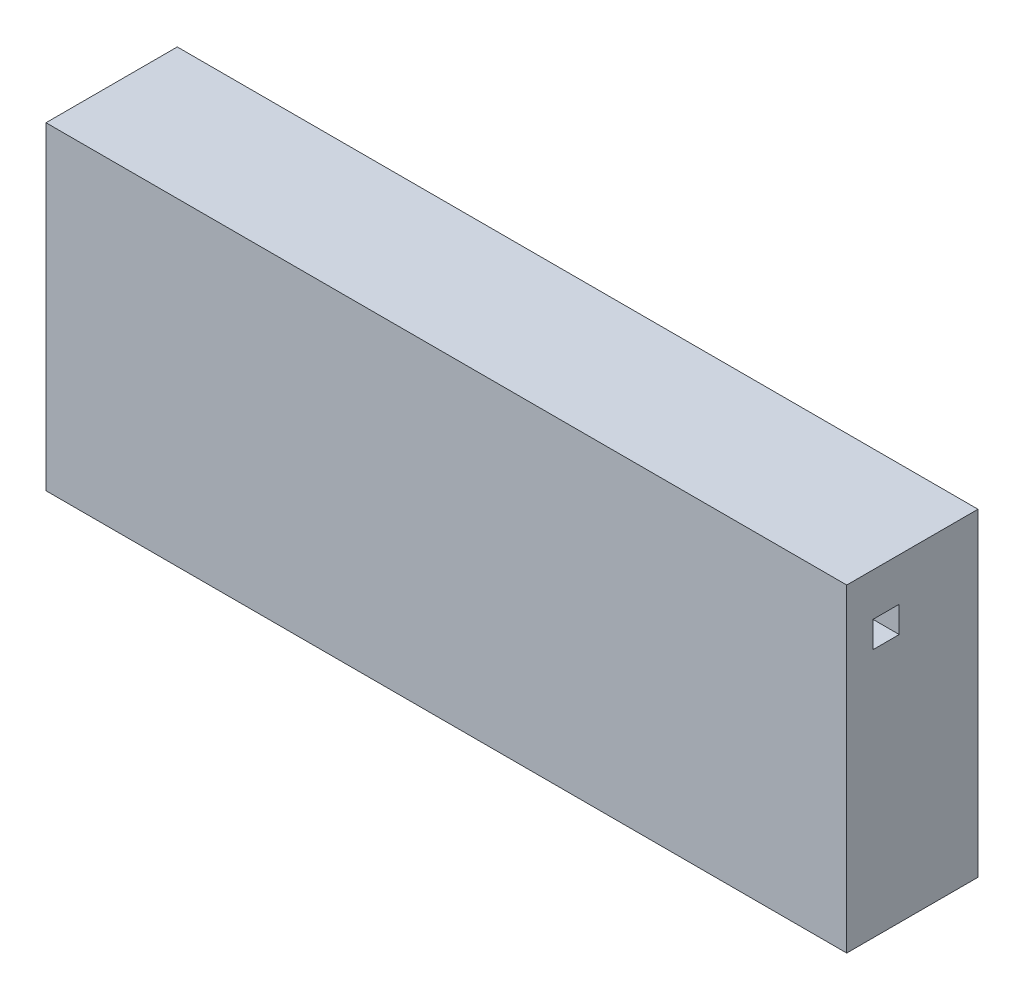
from build123d import *

# Parameters (mm, degrees)
SKIZZE1_W                         = 15.25
SKIZZE1_H                         = 10.05
BASIS_DEPTH                       = 2
KAN_LE_UNTEN_DEPTH                = 0.5
SKIZZE3_W                         = 15.25
SKIZZE3_H                         = 10.05
MITTE_DEPTH                       = 1
SKIZZE6_R                         = 0.25
SKIZZE6_R_2                       = 0.3125
S_ULEN_DEPTH                      = 1.5
SKIZZE4_W                         = 1
SKIZZE4_H                         = 0.499999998
KAN_LE_OBEN_DEPTH                 = 0.5
SKIZZE5_W                         = 15.25
SKIZZE5_H                         = 10.05
DECKEL_DEPTH                      = 1
SKIZZE12_W                        = 15.25
SKIZZE12_H                        = 3.9794873
CHEAT_MACH_ICH_NOCH_SCH_NER_DEPTH = 19.696657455
SCHNITT_LINEAR_START              = -0.5
SKIZZE13_W                        = 15.25
SKIZZE13_H                        = 6.0705127
SCHNITT_LINEAR_AUSTRAGEN1_DEPTH   = 18.934071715
SCHNITT_LINEAR_START_2            = 2
SKIZZE13_2_W                      = 15.25
SKIZZE13_2_H                      = 6.0705127
SCHNITT_LINEAR_AUSTRAGEN2_DEPTH   = 17.434071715


with BuildPart() as part:
    # Skizze1 → Basis (new body)
    with BuildSketch(Plane.XY):
        with Locations((7.625, 5.025)):
            Rectangle(SKIZZE1_W, SKIZZE1_H)
    extrude(amount=BASIS_DEPTH)

    # Skizze2 → Kan_le_unten (cut)
    with BuildSketch(Plane.XY.offset(2)):
        Polygon((0.5, 9.55), (0.75, 9.55), (0.75, 9.23349365), (2.4375, 9.23349365), (2.4375, 8.73349365), (0.75, 8.73349365), (0.75, 8.4169873), (0.5, 8.4169873), align=None)
        Polygon((1.87099365, 6.73349365), (2.1875, 6.73349365), (2.1875, 5.04599365), (2.6875, 5.04599365), (2.6875, 6.73349365), (3.00400635, 6.73349365), (3.00400635, 6.98349365), (1.87099365, 6.98349365), align=None)
        Polygon((6.375, 4.79599365), (4.6875, 4.79599365), (4.6875, 4.4794873), (4.4375, 4.4794873), (4.4375, 5.6125), (4.6875, 5.6125), (4.6875, 5.29599365), (6.375, 5.29599365), align=None)
        Polygon((6.625, 8.98349365), (6.625, 7.29599365), (6.94150635, 7.29599365), (6.94150635, 7.04599365), (5.80849365, 7.04599365), (5.80849365, 7.29599365), (6.125, 7.29599365), (6.125, 8.98349365), align=None)
        Polygon((10.3125, 9.23349365), (8.625, 9.23349365), (8.625, 9.55), (8.375, 9.55), (8.375, 8.4169873), (8.625, 8.4169873), (8.625, 8.73349365), (10.3125, 8.73349365), align=None)
        Polygon((10.0625, 5.04599365), (10.0625, 6.73349365), (9.74599365, 6.73349365), (9.74599365, 6.98349365), (10.87900635, 6.98349365), (10.87900635, 6.73349365), (10.5625, 6.73349365), (10.5625, 5.04599365), align=None)
        Polygon((14.25, 4.79599365), (12.5625, 4.79599365), (12.5625, 4.4794873), (12.3125, 4.4794873), (12.3125, 5.6125), (12.5625, 5.6125), (12.5625, 5.29599365), (14.25, 5.29599365), align=None)
        Polygon((14, 8.98349365), (14, 7.29599365), (13.68349365, 7.29599365), (13.68349365, 7.04599365), (14.81650635, 7.04599365), (14.81650635, 7.29599365), (14.5, 7.29599365), (14.5, 8.98349365), align=None)
    extrude(amount=-KAN_LE_UNTEN_DEPTH, mode=Mode.SUBTRACT)

    # Skizze3 → Mitte (add)
    with BuildSketch(Plane.XY.offset(2)):
        with Locations((7.625, 5.025)):
            Rectangle(SKIZZE3_W, SKIZZE3_H)
    extrude(amount=MITTE_DEPTH)

    # Skizze6 → S_ulen (cut)
    with BuildSketch(Plane.XY.offset(3)):
        with Locations((0.625, 8.4169873)):
            Circle(SKIZZE6_R)
        with Locations((0.625, 9.55)):
            Circle(SKIZZE6_R)
        with Locations((2.4375, 8.98349365)):
            Circle(SKIZZE6_R_2)
        with Locations((2.4375, 5.04599365)):
            Circle(SKIZZE6_R_2)
        with Locations((6.375, 5.04599365)):
            Circle(SKIZZE6_R_2)
        with Locations((6.375, 8.98349365)):
            Circle(SKIZZE6_R_2)
        with Locations((10.3125, 8.98349365)):
            Circle(SKIZZE6_R_2)
        with Locations((10.3125, 5.04599365)):
            Circle(SKIZZE6_R_2)
        with Locations((14.25, 5.04599365)):
            Circle(SKIZZE6_R_2)
        with Locations((14.25, 8.98349365)):
            Circle(SKIZZE6_R_2)
        with Locations((1.87099365, 6.85849365)):
            Circle(SKIZZE6_R)
        with Locations((3.00400635, 6.85849365)):
            Circle(SKIZZE6_R)
        with Locations((4.5625, 5.6125)):
            Circle(SKIZZE6_R)
        with Locations((4.5625, 4.4794873)):
            Circle(SKIZZE6_R)
        with Locations((6.94150635, 7.17099365)):
            Circle(SKIZZE6_R)
        with Locations((5.80849365, 7.17099365)):
            Circle(SKIZZE6_R)
        with Locations((8.5, 8.4169873)):
            Circle(SKIZZE6_R)
        with Locations((8.5, 9.55)):
            Circle(SKIZZE6_R)
        with Locations((9.74599365, 6.85849365)):
            Circle(SKIZZE6_R)
        with Locations((10.87900635, 6.85849365)):
            Circle(SKIZZE6_R)
        with Locations((12.4375, 5.6125)):
            Circle(SKIZZE6_R)
        with Locations((12.4375, 4.4794873)):
            Circle(SKIZZE6_R)
        with Locations((13.68349365, 7.17099365)):
            Circle(SKIZZE6_R)
        with Locations((14.81650635, 7.17099365)):
            Circle(SKIZZE6_R)
    extrude(amount=-S_ULEN_DEPTH, mode=Mode.SUBTRACT)

    # Skizze4 → Kan_le oben (cut)
    with BuildSketch(Plane.XY.offset(3)):
        with BuildLine():
            Line((1.8125, 8.983493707), (2.1875, 6.983493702))
            Line((2.1875, 6.983493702), (1.87099365, 6.983493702))
            Line((1.87099365, 6.983493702), (1.87099365, 6.733493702))
            Line((1.87099365, 6.733493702), (3.00400635, 6.733493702))
            Line((3.00400635, 6.733493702), (3.00400635, 6.983493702))
            Line((3.00400635, 6.983493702), (2.6875, 6.983493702))
            Line((2.6875, 6.983493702), (3.0625, 8.983493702))
            ThreePointArc((3.0625, 8.983493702), (2.437500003, 9.60849365), (1.8125, 8.983493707))
        make_face()
        Polygon((0, 9.233493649), (0, 8.733493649), (0.5, 8.733493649), (0.5, 8.416987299), (0.75, 8.416987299), (0.75, 9.549999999), (0.5, 9.549999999), (0.5, 9.233493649), align=None)
        with BuildLine():
            Line((4.6875, 4.4794873), (4.4375, 4.4794873))
            Line((4.4375, 4.4794873), (4.4375, 4.79599365))
            Line((4.4375, 4.79599365), (2.4375, 4.42099365))
            ThreePointArc((2.4375, 4.42099365), (1.8125, 5.04599365), (2.4375, 5.67099365))
            Line((2.4375, 5.67099365), (4.4375, 5.295993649))
            Line((4.4375, 5.295993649), (4.4375, 5.612499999))
            Line((4.4375, 5.612499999), (4.6875, 5.612499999))
            Line((4.6875, 5.612499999), (4.6875, 4.4794873))
        make_face()
        with BuildLine():
            Line((6.94150635, 7.29599365), (5.808493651, 7.29599365))
            Line((5.808493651, 7.29599365), (5.808493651, 7.04599365))
            Line((5.808493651, 7.04599365), (6.125000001, 7.04599365))
            Line((6.125000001, 7.04599365), (5.75, 5.04599365))
            ThreePointArc((5.75, 5.04599365), (6.375, 4.42099365), (7, 5.04599365))
            Line((7, 5.04599365), (6.6259058, 7.04599365))
            Line((6.6259058, 7.04599365), (6.94150635, 7.04599365))
            Line((6.94150635, 7.04599365), (6.94150635, 7.29599365))
        make_face()
        with BuildLine():
            Line((8.375, 8.73349365), (8.375, 8.416987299))
            Line((8.375, 8.416987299), (8.625, 8.416987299))
            Line((8.625, 8.416987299), (8.625, 9.549999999))
            Line((8.625, 9.549999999), (8.375, 9.549999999))
            Line((8.375, 9.549999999), (8.375, 9.233493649))
            Line((8.375, 9.233493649), (6.375, 9.60849365))
            ThreePointArc((6.375, 9.60849365), (5.75, 8.98349365), (6.375, 8.35849365))
            Line((6.375, 8.35849365), (8.375, 8.73349365))
        make_face()
        with BuildLine():
            Line((10.0625, 6.98349365), (9.74599365, 6.983493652))
            Line((9.74599365, 6.983493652), (9.74599365, 6.73349365))
            Line((9.74599365, 6.73349365), (10.877050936, 6.73349365))
            Line((10.877050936, 6.73349365), (10.877050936, 6.98349365))
            Line((10.877050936, 6.98349365), (10.562499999, 6.98349365))
            Line((10.562499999, 6.98349365), (10.9375, 8.98349365))
            ThreePointArc((10.9375, 8.98349365), (10.3125, 9.60849365), (9.6875, 8.98349365))
            Line((9.6875, 8.98349365), (10.0625, 6.98349365))
        make_face()
        with BuildLine():
            Line((12.3125, 5.295993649), (12.3125, 5.6125))
            Line((12.3125, 5.6125), (12.5625, 5.6125))
            Line((12.5625, 5.6125), (12.5625, 4.4794873))
            Line((12.5625, 4.4794873), (12.3125, 4.4794873))
            Line((12.3125, 4.4794873), (12.3125, 4.79599365))
            Line((12.3125, 4.79599365), (10.3125, 4.42099365))
            ThreePointArc((10.3125, 4.42099365), (9.6875, 5.04599365), (10.3125, 5.67099365))
            Line((10.3125, 5.67099365), (12.3125, 5.295993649))
        make_face()
        with BuildLine():
            Line((14, 7.04599365), (13.685521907, 7.04599365))
            Line((13.685521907, 7.04599365), (13.685521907, 7.29599365))
            Line((13.685521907, 7.29599365), (14.81650635, 7.29599365))
            Line((14.81650635, 7.29599365), (14.81650635, 7.04599365))
            Line((14.81650635, 7.04599365), (14.5, 7.04599365))
            Line((14.5, 7.04599365), (14.875, 5.04599365))
            ThreePointArc((14.875, 5.04599365), (14.25, 4.42099365), (13.625, 5.04599365))
            Line((13.625, 5.04599365), (14, 7.04599365))
        make_face()
        with Locations((14.75, 8.98349365)):
            Rectangle(SKIZZE4_W, SKIZZE4_H)
    extrude(amount=-KAN_LE_OBEN_DEPTH, mode=Mode.SUBTRACT)

    # Skizze5 → Deckel (add)
    with BuildSketch(Plane.XY.offset(3)):
        with Locations((7.625, 5.025)):
            Rectangle(SKIZZE5_W, SKIZZE5_H)
    extrude(amount=DECKEL_DEPTH)

    # Skizze12 → Cheat _mach ich noch sch_ner (cut, through all)
    with BuildSketch(Plane.XY.offset(4)):
        with Locations((7.625, 1.98974365)):
            Rectangle(SKIZZE12_W, SKIZZE12_H)
    extrude(amount=-CHEAT_MACH_ICH_NOCH_SCH_NER_DEPTH, mode=Mode.SUBTRACT)

    # Skizze13 → Schnitt-Linear austragen1 (cut, through all)
    with BuildSketch(Plane.XY.offset(1.5).offset(SCHNITT_LINEAR_START)):
        with Locations((7.625, 7.01474365)):
            Rectangle(SKIZZE13_W, SKIZZE13_H)
    extrude(amount=-SCHNITT_LINEAR_AUSTRAGEN1_DEPTH, mode=Mode.SUBTRACT)

    # Skizze13_2 → Schnitt-Linear austragen2 (cut, through all)
    with BuildSketch(Plane.XY.offset(1.5).offset(SCHNITT_LINEAR_START_2)):
        with Locations((7.625, 7.01474365)):
            Rectangle(SKIZZE13_2_W, SKIZZE13_2_H)
    extrude(amount=SCHNITT_LINEAR_AUSTRAGEN2_DEPTH, mode=Mode.SUBTRACT)


solid = part.part
